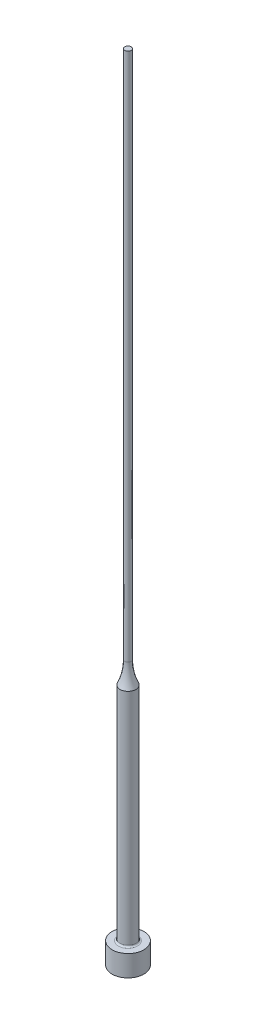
from build123d import *


with BuildPart() as part:
    # Sketch1 → Revolve1 (revolve)
    with BuildSketch(Plane.XY, mode=Mode.PRIVATE) as revolve1_sk:
        with BuildLine():
            Line((0, 0), (3, 0))
            Line((3, 0), (3, 4))
            Line((3, 4), (1.8, 4))
            ThreePointArc((1.8, 4), (1.587867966, 4.087867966), (1.5, 4.3))
            Line((1.5, 4.3), (1.5, 45.853917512))
            ThreePointArc((1.5, 45.853917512), (0.827589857, 47.878679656), (0.6, 50))
            Line((0.6, 50), (0.6, 150))
            Line((0.6, 150), (0, 150))
            Line((0, 150), (0, 0))
        make_face()
    revolve(revolve1_sk.sketch.rotate(Axis((0, 150, 0), (0, -1, 0)), 180), axis=Axis((0, 150, 0), (0, -1, 0)))


solid = part.part
